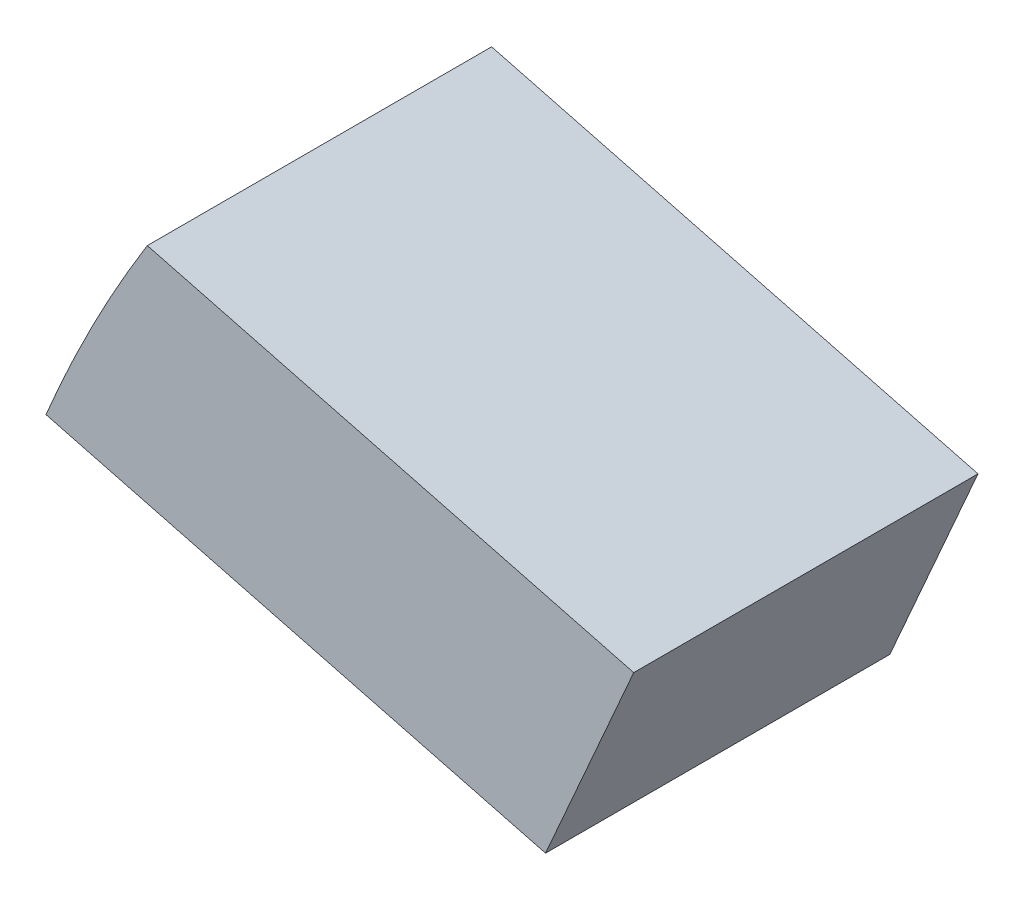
ISO-10303-21;
HEADER;
FILE_DESCRIPTION(('STEP AP214'),'2;1');
FILE_NAME('part.step','',(''),(''),'','','');
FILE_SCHEMA(('AUTOMOTIVE_DESIGN { 1 0 10303 214 1 1 1 1 }'));
ENDSEC;
DATA;
#1=APPLICATION_CONTEXT('core data for automotive mechanical design processes');
#2=APPLICATION_PROTOCOL_DEFINITION('international standard','automotive_design',2000,#1);
#3=PRODUCT_CONTEXT('',#1,'mechanical');
#4=PRODUCT('Part','Part','',(#3));
#5=PRODUCT_RELATED_PRODUCT_CATEGORY('part','',(#4));
#6=PRODUCT_DEFINITION_FORMATION('','',#4);
#7=PRODUCT_DEFINITION_CONTEXT('part definition',#1,'design');
#8=PRODUCT_DEFINITION('design','',#6,#7);
#9=PRODUCT_DEFINITION_SHAPE('','',#8);
#10=(LENGTH_UNIT() NAMED_UNIT(*) SI_UNIT(.MILLI.,.METRE.));
#11=(NAMED_UNIT(*) PLANE_ANGLE_UNIT() SI_UNIT($,.RADIAN.));
#12=(NAMED_UNIT(*) SI_UNIT($,.STERADIAN.) SOLID_ANGLE_UNIT());
#13=UNCERTAINTY_MEASURE_WITH_UNIT(LENGTH_MEASURE(1.E-05),#10,'distance_accuracy_value','');
#14=(GEOMETRIC_REPRESENTATION_CONTEXT(3) GLOBAL_UNCERTAINTY_ASSIGNED_CONTEXT((#13)) GLOBAL_UNIT_ASSIGNED_CONTEXT((#10,
#11,#12)) REPRESENTATION_CONTEXT('',''));
#15=CARTESIAN_POINT('',(0.,0.,0.));
#16=DIRECTION('',(0.,0.,1.));
#17=DIRECTION('',(1.,0.,0.));
#18=AXIS2_PLACEMENT_3D('',#15,#16,#17);
#19=CARTESIAN_POINT('',(-19.6349919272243,9.23334663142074,6.35));
#20=DIRECTION('',(-0.251950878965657,-0.967740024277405,0.));
#21=DIRECTION('',(0.967740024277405,-0.251950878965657,0.));
#22=AXIS2_PLACEMENT_3D('',#19,#20,#21);
#23=PLANE('',#22);
#24=DIRECTION('',(-0.967740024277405,0.251950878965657,0.));
#25=VECTOR('',#24,1.);
#26=CARTESIAN_POINT('',(-19.6349919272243,9.23334663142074,0.));
#27=LINE('',#26,#25);
#28=CARTESIAN_POINT('',(-10.6636040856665,6.89764799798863,0.));
#29=VERTEX_POINT('',#28);
#30=CARTESIAN_POINT('',(-19.6349919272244,9.23334663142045,0.));
#31=VERTEX_POINT('',#30);
#32=EDGE_CURVE('E116',#29,#31,#27,.T.);
#33=ORIENTED_EDGE('',*,*,#32,.T.);
#34=DIRECTION('',(0.,0.,-1.));
#35=VECTOR('',#34,1.);
#36=CARTESIAN_POINT('',(-19.6349919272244,9.23334663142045,6.35));
#37=LINE('',#36,#35);
#38=CARTESIAN_POINT('',(-19.6349919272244,9.23334663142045,6.35));
#39=VERTEX_POINT('',#38);
#40=EDGE_CURVE('E11',#39,#31,#37,.T.);
#41=ORIENTED_EDGE('',*,*,#40,.F.);
#42=DIRECTION('',(-0.967740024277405,0.251950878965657,0.));
#43=VECTOR('',#42,1.);
#44=CARTESIAN_POINT('',(-19.6349919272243,9.23334663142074,6.35));
#45=LINE('',#44,#43);
#46=CARTESIAN_POINT('',(-10.6636040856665,6.89764799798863,6.35));
#47=VERTEX_POINT('',#46);
#48=EDGE_CURVE('E96',#47,#39,#45,.T.);
#49=ORIENTED_EDGE('',*,*,#48,.F.);
#50=DIRECTION('',(0.,0.,-1.));
#51=VECTOR('',#50,1.);
#52=CARTESIAN_POINT('',(-10.6636040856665,6.89764799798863,6.35));
#53=LINE('',#52,#51);
#54=EDGE_CURVE('E109',#47,#29,#53,.T.);
#55=ORIENTED_EDGE('',*,*,#54,.T.);
#56=EDGE_LOOP('',(#33,#41,#49,#55));
#57=FACE_BOUND('',#56,.T.);
#58=ADVANCED_FACE('F38',(#57),#23,.F.);
#59=CARTESIAN_POINT('',(-19.6349919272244,9.23334663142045,6.35));
#60=CARTESIAN_POINT('',(-20.7153931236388,7.49167670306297,6.35));
#61=CARTESIAN_POINT('',(-21.5041243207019,5.59859351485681,6.35));
#62=B_SPLINE_CURVE_WITH_KNOTS('',2,(#59,#60,#61),.UNSPECIFIED.,.F.,.F.,(3,3),(0.,1.),.UNSPECIFIED.);
#63=DIRECTION('',(0.,0.,-1.));
#64=VECTOR('',#63,1.);
#65=SURFACE_OF_LINEAR_EXTRUSION('',#62,#64);
#66=CARTESIAN_POINT('',(-19.6349919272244,9.23334663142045,0.));
#67=CARTESIAN_POINT('',(-20.7153931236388,7.49167670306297,0.));
#68=CARTESIAN_POINT('',(-21.5041243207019,5.59859351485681,0.));
#69=B_SPLINE_CURVE_WITH_KNOTS('',2,(#66,#67,#68),.UNSPECIFIED.,.F.,.F.,(3,3),(0.,1.),.UNSPECIFIED.);
#70=CARTESIAN_POINT('',(-21.5041243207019,5.59859351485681,0.));
#71=VERTEX_POINT('',#70);
#72=EDGE_CURVE('E101',#31,#71,#69,.T.);
#73=ORIENTED_EDGE('',*,*,#72,.T.);
#74=DIRECTION('',(0.,0.,-1.));
#75=VECTOR('',#74,1.);
#76=CARTESIAN_POINT('',(-21.5041243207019,5.59859351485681,6.35));
#77=LINE('',#76,#75);
#78=CARTESIAN_POINT('',(-21.5041243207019,5.59859351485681,6.35));
#79=VERTEX_POINT('',#78);
#80=EDGE_CURVE('E47',#79,#71,#77,.T.);
#81=ORIENTED_EDGE('',*,*,#80,.F.);
#82=EDGE_CURVE('E91',#39,#79,#62,.T.);
#83=ORIENTED_EDGE('',*,*,#82,.F.);
#84=ORIENTED_EDGE('',*,*,#40,.T.);
#85=EDGE_LOOP('',(#73,#81,#83,#84));
#86=FACE_BOUND('',#85,.T.);
#87=ADVANCED_FACE('F100',(#86),#65,.F.);
#88=CARTESIAN_POINT('',(-12.2902983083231,3.19977616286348,6.35));
#89=DIRECTION('',(0.251950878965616,0.967740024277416,0.));
#90=DIRECTION('',(-0.967740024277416,0.251950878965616,0.));
#91=AXIS2_PLACEMENT_3D('',#88,#89,#90);
#92=PLANE('',#91);
#93=DIRECTION('',(0.967740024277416,-0.251950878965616,0.));
#94=VECTOR('',#93,1.);
#95=CARTESIAN_POINT('',(-12.2902983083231,3.19977616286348,0.));
#96=LINE('',#95,#94);
#97=CARTESIAN_POINT('',(-12.2902983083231,3.19977616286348,0.));
#98=VERTEX_POINT('',#97);
#99=EDGE_CURVE('E78',#71,#98,#96,.T.);
#100=ORIENTED_EDGE('',*,*,#99,.T.);
#101=DIRECTION('',(0.,0.,-1.));
#102=VECTOR('',#101,1.);
#103=CARTESIAN_POINT('',(-12.2902983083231,3.19977616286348,6.35));
#104=LINE('',#103,#102);
#105=CARTESIAN_POINT('',(-12.2902983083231,3.19977616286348,6.35));
#106=VERTEX_POINT('',#105);
#107=EDGE_CURVE('E103',#106,#98,#104,.T.);
#108=ORIENTED_EDGE('',*,*,#107,.F.);
#109=DIRECTION('',(0.967740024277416,-0.251950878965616,0.));
#110=VECTOR('',#109,1.);
#111=CARTESIAN_POINT('',(-12.2902983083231,3.19977616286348,6.35));
#112=LINE('',#111,#110);
#113=EDGE_CURVE('E94',#79,#106,#112,.T.);
#114=ORIENTED_EDGE('',*,*,#113,.F.);
#115=ORIENTED_EDGE('',*,*,#80,.T.);
#116=EDGE_LOOP('',(#100,#108,#114,#115));
#117=FACE_BOUND('',#116,.T.);
#118=ADVANCED_FACE('F104',(#117),#92,.F.);
#119=CARTESIAN_POINT('',(-10.6636040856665,6.89764799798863,6.35));
#120=DIRECTION('',(-0.915348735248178,0.402662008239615,0.));
#121=DIRECTION('',(-0.402662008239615,-0.915348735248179,0.));
#122=AXIS2_PLACEMENT_3D('',#119,#120,#121);
#123=PLANE('',#122);
#124=DIRECTION('',(0.402662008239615,0.915348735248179,0.));
#125=VECTOR('',#124,1.);
#126=CARTESIAN_POINT('',(-10.6636040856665,6.89764799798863,0.));
#127=LINE('',#126,#125);
#128=EDGE_CURVE('E84',#98,#29,#127,.T.);
#129=ORIENTED_EDGE('',*,*,#128,.T.);
#130=ORIENTED_EDGE('',*,*,#54,.F.);
#131=DIRECTION('',(0.402662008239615,0.915348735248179,0.));
#132=VECTOR('',#131,1.);
#133=CARTESIAN_POINT('',(-10.6636040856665,6.89764799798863,6.35));
#134=LINE('',#133,#132);
#135=EDGE_CURVE('E58',#106,#47,#134,.T.);
#136=ORIENTED_EDGE('',*,*,#135,.F.);
#137=ORIENTED_EDGE('',*,*,#107,.T.);
#138=EDGE_LOOP('',(#129,#130,#136,#137));
#139=FACE_BOUND('',#138,.T.);
#140=ADVANCED_FACE('F133',(#139),#123,.F.);
#141=CARTESIAN_POINT('',(-20.642475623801,7.4538233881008,6.35));
#142=DIRECTION('',(0.,0.,-1.));
#143=DIRECTION('',(-1.,0.,0.));
#144=AXIS2_PLACEMENT_3D('',#141,#142,#143);
#145=PLANE('',#144);
#146=ORIENTED_EDGE('',*,*,#48,.T.);
#147=ORIENTED_EDGE('',*,*,#82,.T.);
#148=ORIENTED_EDGE('',*,*,#113,.T.);
#149=ORIENTED_EDGE('',*,*,#135,.T.);
#150=EDGE_LOOP('',(#146,#147,#148,#149));
#151=FACE_BOUND('',#150,.T.);
#152=ADVANCED_FACE('F92',(#151),#145,.F.);
#153=CARTESIAN_POINT('',(-20.642475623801,7.4538233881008,0.));
#154=DIRECTION('',(0.,0.,-1.));
#155=DIRECTION('',(-1.,0.,0.));
#156=AXIS2_PLACEMENT_3D('',#153,#154,#155);
#157=PLANE('',#156);
#158=ORIENTED_EDGE('',*,*,#32,.F.);
#159=ORIENTED_EDGE('',*,*,#128,.F.);
#160=ORIENTED_EDGE('',*,*,#99,.F.);
#161=ORIENTED_EDGE('',*,*,#72,.F.);
#162=EDGE_LOOP('',(#158,#159,#160,#161));
#163=FACE_BOUND('',#162,.T.);
#164=ADVANCED_FACE('F136',(#163),#157,.T.);
#165=CLOSED_SHELL('',(#58,#87,#118,#140,#152,#164));
#166=MANIFOLD_SOLID_BREP('B2',#165);
#167=ADVANCED_BREP_SHAPE_REPRESENTATION('',(#18,#166),#14);
#168=SHAPE_DEFINITION_REPRESENTATION(#9,#167);
ENDSEC;
END-ISO-10303-21;
